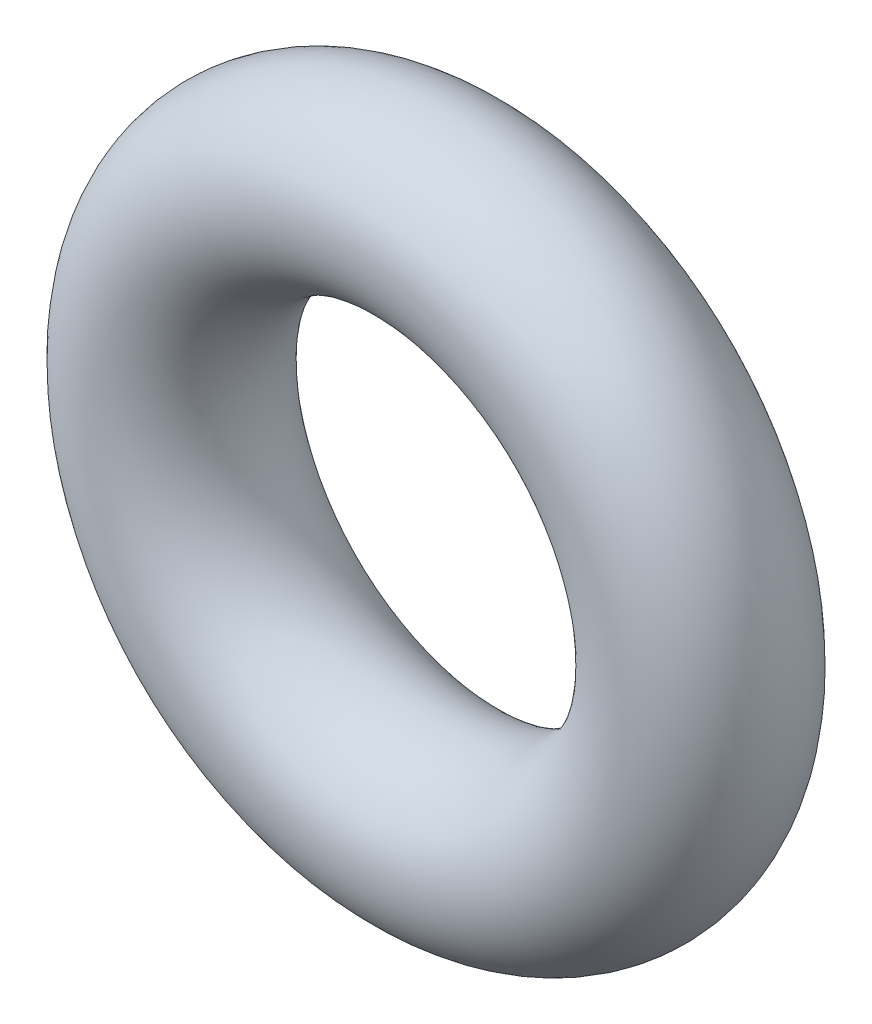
from build123d import *

# Parameters (mm, degrees)
SKETCH_1_R = 10


with BuildPart() as part:
    # Sketch 1 → Revolve 1 (revolve)
    with BuildSketch(Plane(origin=(0, 0, 0), x_dir=(1, 0, 0), z_dir=(0, 1, 0))):
        with Locations((-30, 0)):
            Circle(SKETCH_1_R)
    revolve(axis=Axis((0, 0, -89.273529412), (0, 0, 1)))


solid = part.part
